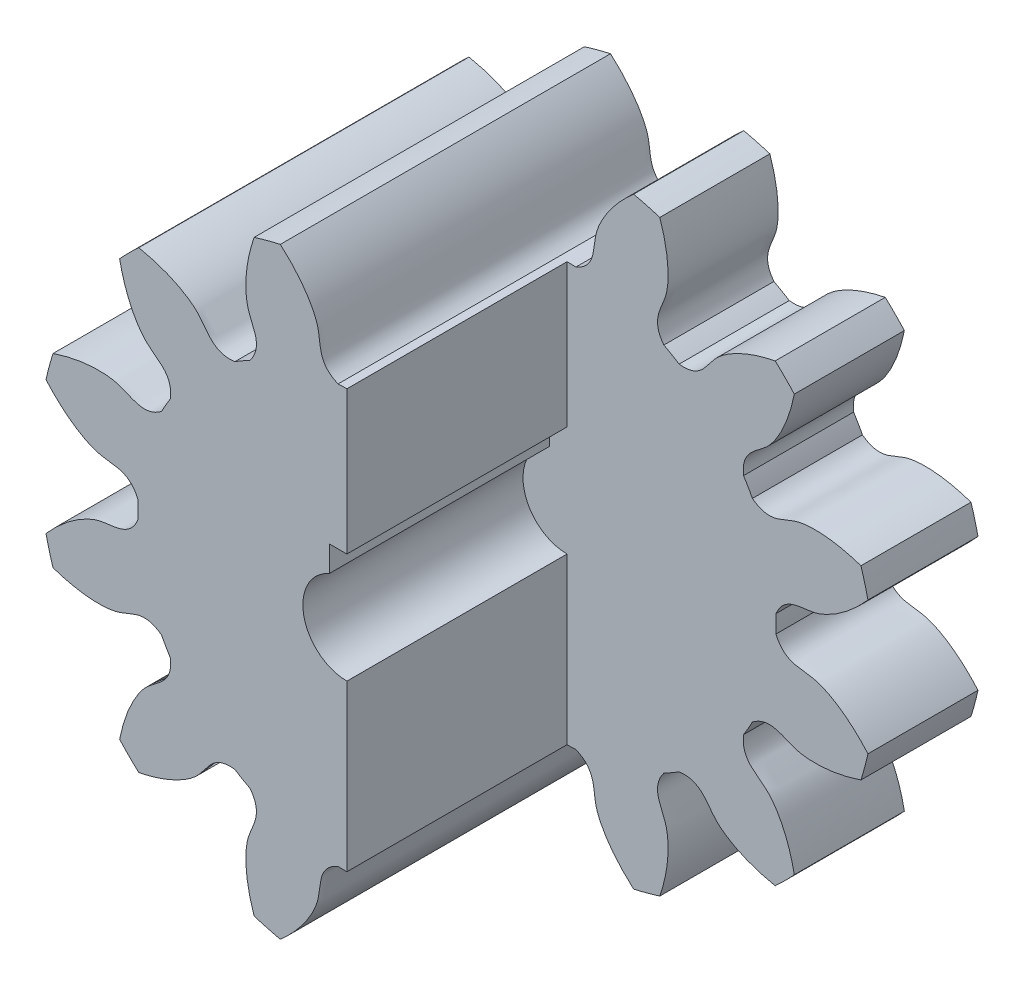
from build123d import *

# Parameters (mm, degrees)
SKETCH_1_R               = 14
EXTRUDE_1_DEPTH          = 15
CUT_EXTRUDE_1_DEPTH      = 25.839484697
PATTERN_CIRCULAR_1_COUNT = 12
CUT_EXTRUDE_2_DEPTH      = 10
CUT_EXTRUDE_START        = -10
CUT_EXTRUDE_3_DEPTH      = 10


with BuildPart() as part:
    # Sketch 1 → Extrude 1 (new body)
    with BuildSketch(Plane.XY):
        Circle(SKETCH_1_R)
    extrude(amount=EXTRUDE_1_DEPTH)

    # Sketch 2 → Cut-Extrude 1 (cut, through all)
    with BuildSketch(Plane.XY):
        with BuildLine():
            ThreePointArc((0.401680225, 9.491504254), (0, 9.5), (-0.401680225, 9.491504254))
            add(Edge.make_bspline(
                [(-0.401680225, 9.491504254), (-1.361577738, 9.898614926), (-1.148746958, 10.689637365), (-1.352304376, 11.378961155), (-1.365247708, 11.419811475), (-1.380454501, 11.46466685), (-1.398085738, 11.513452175), (-1.41830525, 11.566086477), (-1.441273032, 11.622484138), (-1.467147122, 11.682554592), (-1.496082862, 11.746202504), (-1.528232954, 11.813327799), (-1.563747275, 11.883825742), (-1.602772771, 11.957587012), (-1.645453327, 12.034497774), (-1.691929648, 12.114439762), (-1.742339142, 12.197290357), (-1.796815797, 12.282922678), (-1.855490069, 12.371205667), (-1.918488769, 12.462004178), (-1.985934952, 12.555179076), (-2.057947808, 12.650587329), (-2.134642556, 12.748082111), (-2.216130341, 12.847512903), (-2.302518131, 12.948725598), (-2.39390862, 13.051562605), (-2.490400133, 13.155862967), (-2.59208653, 13.261462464), (-2.699057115, 13.368193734), (-2.811396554, 13.475886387), (-2.929184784, 13.584367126), (-3.052496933, 13.693459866), (-3.181403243, 13.802985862), (-3.31596899, 13.912763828), (-3.456254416, 14.02261007), (-3.602314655, 14.132338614), (-3.754199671, 14.241761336), (-3.911954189, 14.350688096), (-4.07561764, 14.458926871), (-4.2452241, 14.566283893), (-4.420802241, 14.672563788), (-4.602375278, 14.77756971), (-4.789960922, 14.881103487), (-4.983571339, 14.98296576), (-5.183213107, 15.082956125), (-5.388887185, 15.18087328), (-5.600588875, 15.276515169), (-5.818307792, 15.369679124), (-6.042027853, 15.460162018), (-6.27172721, 15.547760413), (-6.588759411, 15.661455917), (-6.8311872, 15.740202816), (-6.995210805, 15.78994182)],
                knots=[0, 0, 0, 0, 0.218015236, 0.222043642, 0.226545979, 0.231522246, 0.236972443, 0.24289657, 0.249294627, 0.256166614, 0.263512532, 0.271332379, 0.279626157, 0.288393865, 0.297635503, 0.307351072, 0.31754057, 0.328203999, 0.339341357, 0.350952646, 0.363037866, 0.375597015, 0.388630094, 0.402137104, 0.416118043, 0.430572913, 0.445501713, 0.460904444, 0.476781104, 0.493131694, 0.509956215, 0.527254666, 0.545027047, 0.563273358, 0.581993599, 0.601187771, 0.620855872, 0.640997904, 0.661613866, 0.682703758, 0.704267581, 0.726305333, 0.748817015, 0.771802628, 0.795262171, 0.819195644, 0.843603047, 0.868484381, 0.893839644, 0.919668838, 0.945971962, 1, 1, 1, 1], degree=3))
            ThreePointArc((-6.995210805, 15.78994182), (0, 17.270067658), (6.995210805, 15.78994182))
            add(Edge.make_bspline(
                [(0.401680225, 9.491504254), (1.361577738, 9.898614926), (1.148746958, 10.689637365), (1.352304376, 11.378961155), (1.365247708, 11.419811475), (1.380454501, 11.46466685), (1.398085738, 11.513452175), (1.41830525, 11.566086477), (1.441273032, 11.622484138), (1.467147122, 11.682554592), (1.496082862, 11.746202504), (1.528232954, 11.813327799), (1.563747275, 11.883825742), (1.602772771, 11.957587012), (1.645453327, 12.034497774), (1.691929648, 12.114439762), (1.742339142, 12.197290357), (1.796815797, 12.282922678), (1.855490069, 12.371205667), (1.918488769, 12.462004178), (1.985934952, 12.555179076), (2.057947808, 12.650587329), (2.134642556, 12.748082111), (2.216130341, 12.847512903), (2.302518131, 12.948725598), (2.39390862, 13.051562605), (2.490400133, 13.155862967), (2.59208653, 13.261462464), (2.699057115, 13.368193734), (2.811396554, 13.475886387), (2.929184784, 13.584367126), (3.052496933, 13.693459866), (3.181403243, 13.802985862), (3.31596899, 13.912763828), (3.456254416, 14.02261007), (3.602314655, 14.132338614), (3.754199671, 14.241761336), (3.911954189, 14.350688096), (4.07561764, 14.458926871), (4.2452241, 14.566283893), (4.420802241, 14.672563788), (4.602375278, 14.77756971), (4.789960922, 14.881103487), (4.983571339, 14.98296576), (5.183213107, 15.082956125), (5.388887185, 15.18087328), (5.600588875, 15.276515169), (5.818307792, 15.369679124), (6.042027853, 15.460162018), (6.27172721, 15.547760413), (6.588759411, 15.661455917), (6.8311872, 15.740202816), (6.995210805, 15.78994182)],
                knots=[0, 0, 0, 0, 0.218015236, 0.222043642, 0.226545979, 0.231522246, 0.236972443, 0.24289657, 0.249294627, 0.256166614, 0.263512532, 0.271332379, 0.279626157, 0.288393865, 0.297635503, 0.307351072, 0.31754057, 0.328203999, 0.339341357, 0.350952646, 0.363037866, 0.375597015, 0.388630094, 0.402137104, 0.416118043, 0.430572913, 0.445501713, 0.460904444, 0.476781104, 0.493131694, 0.509956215, 0.527254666, 0.545027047, 0.563273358, 0.581993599, 0.601187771, 0.620855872, 0.640997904, 0.661613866, 0.682703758, 0.704267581, 0.726305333, 0.748817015, 0.771802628, 0.795262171, 0.819195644, 0.843603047, 0.868484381, 0.893839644, 0.919668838, 0.945971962, 1, 1, 1, 1], degree=3))
        make_face()
    cut_extrude_1 = extrude(amount=CUT_EXTRUDE_1_DEPTH, mode=Mode.SUBTRACT)

    # Pattern Circular 1: Cut-Extrude 1 ×12 about axis
    pattern_circular_1_axis = Axis((0, 0, 15), (0, 0, -1))
    for i in range(1, PATTERN_CIRCULAR_1_COUNT):
        add(cut_extrude_1.rotate(pattern_circular_1_axis, i * 360 / PATTERN_CIRCULAR_1_COUNT), mode=Mode.SUBTRACT)

    # Sketch 4 → Cut-Extrude 2 (cut)
    with BuildSketch(Plane.XY.offset(15)):
        with BuildLine():
            ThreePointArc((2, 0), (1.673320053, 1.095445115), (0.8, 1.833030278))
            Line((0.8, 1.833030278), (0.8, 1))
            Line((0.8, 1), (-0.8, 1))
            Line((-0.8, 1), (-0.8, 1.833030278))
            ThreePointArc((-0.8, 1.833030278), (-1.095445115, -1.673320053), (2, 0))
        make_face()
        with BuildLine():
            Line((0.8, 1), (0.8, 1.833030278))
            ThreePointArc((0.8, 1.833030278), (0, 2), (-0.8, 1.833030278))
            Line((-0.8, 1.833030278), (-0.8, 1))
            Line((-0.8, 1), (0.8, 1))
        make_face()
        with BuildLine():
            ThreePointArc((2, 0), (1.673320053, 1.095445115), (0.8, 1.833030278))
            Line((0.8, 1.833030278), (0.8, 1))
            Line((0.8, 1), (-0.8, 1))
            Line((-0.8, 1), (-0.8, 1.833030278))
            ThreePointArc((-0.8, 1.833030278), (-1.095445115, -1.673320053), (2, 0))
        make_face()
        with BuildLine():
            Line((0.8, 1), (0.8, 1.833030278))
            ThreePointArc((0.8, 1.833030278), (0, 2), (-0.8, 1.833030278))
            Line((-0.8, 1.833030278), (-0.8, 1))
            Line((-0.8, 1), (0.8, 1))
        make_face()
        with BuildLine():
            Line((0.8, 1.833030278), (0.8, 3))
            Line((0.8, 3), (-0.8, 3))
            Line((-0.8, 3), (-0.8, 1.833030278))
            ThreePointArc((-0.8, 1.833030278), (0, 2), (0.8, 1.833030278))
        make_face()
    extrude(amount=-CUT_EXTRUDE_2_DEPTH, mode=Mode.SUBTRACT)

    # Sketch 6 → Cut-Extrude 3 (cut)
    with BuildSketch(Plane.XY.offset(15).offset(CUT_EXTRUDE_START)):
        with BuildLine():
            Line((0, 14), (0, -14))
            ThreePointArc((0, -14), (14, 0), (0, 14))
        make_face()
    extrude(amount=CUT_EXTRUDE_3_DEPTH, mode=Mode.SUBTRACT)


solid = part.part
